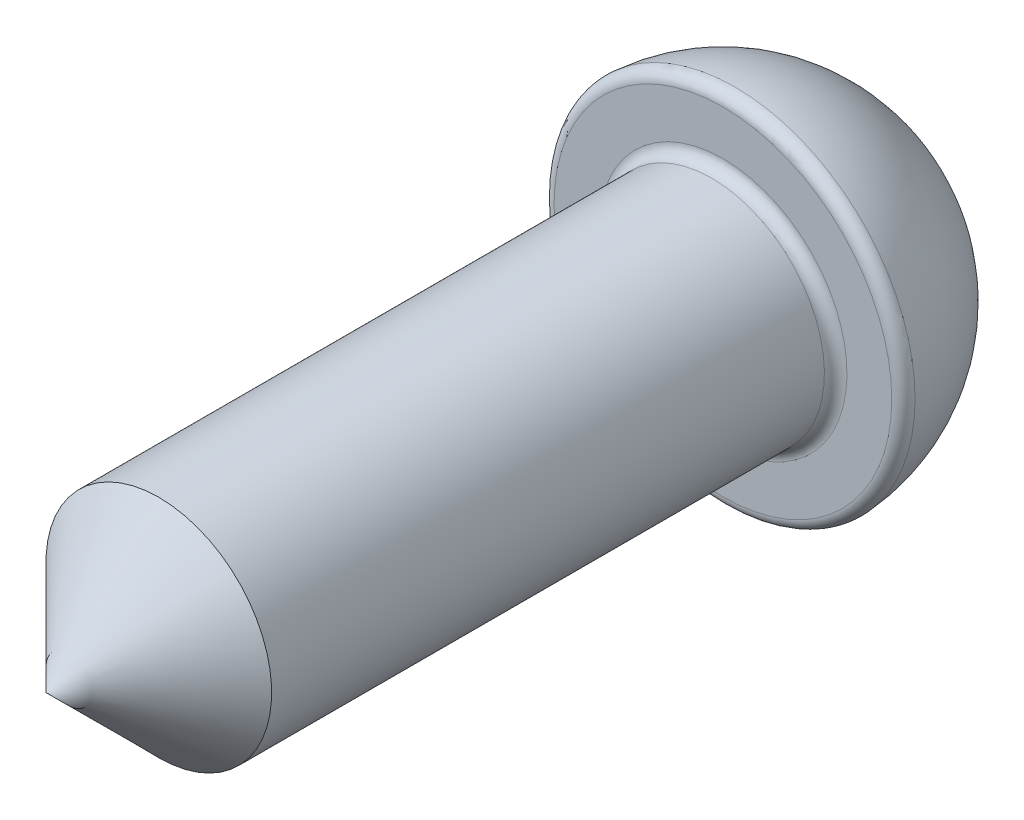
from build123d import *

# Parameters (mm, degrees)
FILLET_1_R = 0.25


with BuildPart() as part:
    # Sketch 1 → Revolve 1 (revolve)
    with BuildSketch(Plane(origin=(0, 0, 0), x_dir=(0, 0, -1), z_dir=(1, 0, 0)), mode=Mode.PRIVATE) as revolve_1_sk:
        with BuildLine():
            Line((-9.5, 0), (9.5, 0))
            ThreePointArc((9.5, 0), (8.328427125, 2.828427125), (5.5, 4))
            Line((5.5, 4), (5.5, 2.5))
            Line((5.5, 2.5), (-7, 2.5))
            Line((-7, 2.5), (-9.5, 0))
        make_face()
    revolve(revolve_1_sk.sketch.rotate(Axis((0, 0, 9.5), (0, 0, -1)), 180), axis=Axis((0, 0, 9.5), (0, 0, -1)))

    # Fillet 1
    fillet_1_edges = [part.edges().sort_by_distance(p)[0] for p in [
        (0, 2.5, -5.5),
        (0, 4, -5.5),
    ]]
    fillet(fillet_1_edges, radius=FILLET_1_R)


solid = part.part
